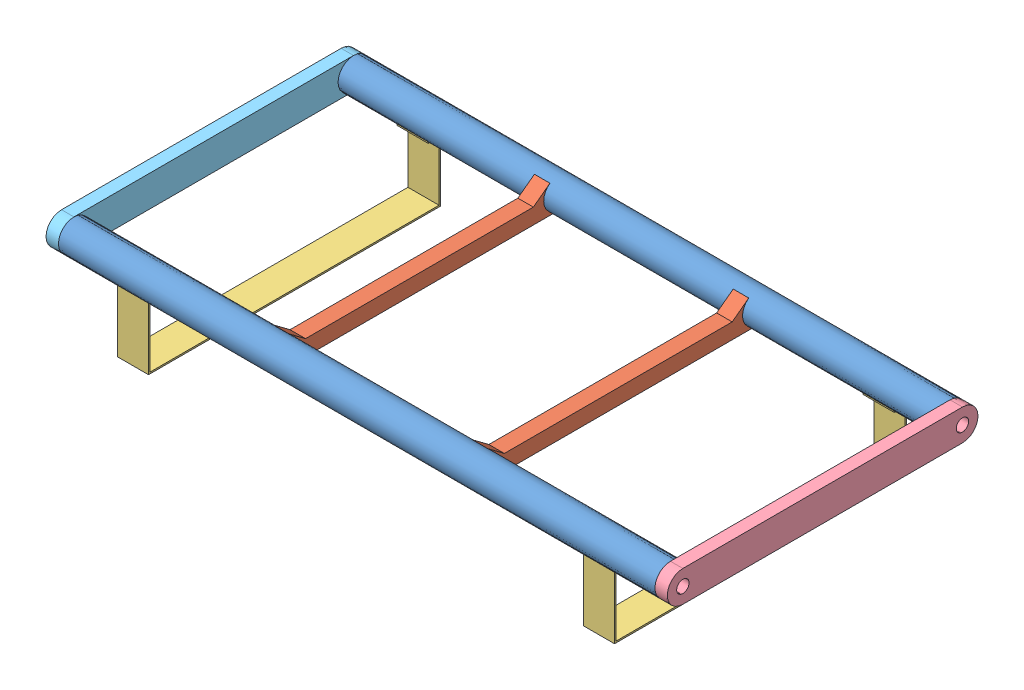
SolidWorks assembly struttura-portante-a.SLDASM, configuration Default (file format 7000). Lengths in mm.
Overall size (1800 270 900).
8 component instances, 5 part files, 2 mates.
Components (placement in the parent):
- tubo-1728-90-2-mm-a-1: tubo-1728-90-2-mm-a.SLDPRT [Default] at (2.6249 -0.9125 1728) size (1728 90 90)
- tubo-1728-90-2-mm-a-2: tubo-1728-90-2-mm-a.SLDPRT [Default] at (2.6249 -0.9125 918) size (1728 90 90)
- traversina-h-45-mm-a-1: traversina-h-45-mm-a.SLDPRT [Default] at (-576 -0.9125 1728) size (45 81 810)
- traversina-h-45-mm-a-2: traversina-h-45-mm-a.SLDPRT [Default] at (-1152 -0.9125 1728) size (45 81 810)
- piede-a-1: piede-a.SLDPRT [Default] at (-141.3751 -225.9125 1745.9957) size (90 180 846)
- piede-a-2: piede-a.SLDPRT [Default] at (-1491.3751 -225.9125 1745.9957) size (90 180 846)
- spalla-dx-36-mm-a-lineare-1: spalla-dx-36-mm-a-lineare.SLDPRT [Default] at (38.6249 -0.9125 1728) size (36 90 900)
- spalla-sx-36-mm-a-lineare-1: spalla-sx-36-mm-a-lineare.SLDPRT [Default] at (-1761.3751 -0.9125 1728) size (36 90 900)
Mates (geometry in assembly coordinates):
- Coincident1: coincident aligned: circle of tubo-1728-90-2-mm-a-1; circle of spalla-dx-36-mm-a-lineare-1
- Coincident2: coincident aligned: circle of tubo-1728-90-2-mm-a-1; circle of spalla-sx-36-mm-a-lineare-1
